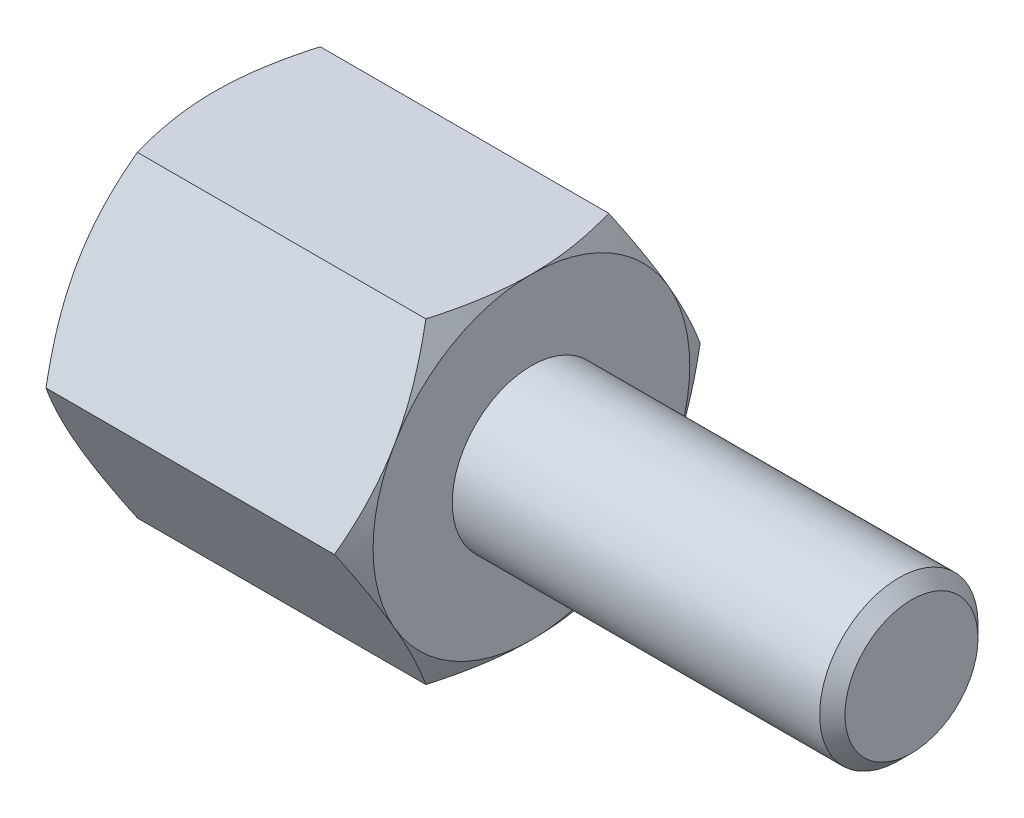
from build123d import *

# Parameters (mm, degrees)
EXTRUDE2_DEPTH = 2.5
SKETCH3_R      = 1.05
EXTRUDE3_DEPTH = 2.5
SKETCH5_R      = 1.25
EXTRUDE4_DEPTH = 6
CHAMFER1_SIZE  = 0.2


with BuildPart() as part:
    # Sketch1 → Extrude2 (new, symmetric)
    with BuildSketch(Plane(origin=(0, 0, 0), x_dir=(0, 0, -1), z_dir=(1, 0, 0))):
        Polygon((1.443375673, 2.5), (-1.443375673, 2.5), (-2.886751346, 0), (-1.443375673, -2.5), (1.443375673, -2.5), (2.886751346, 0), align=None)
    extrude(amount=EXTRUDE2_DEPTH, both=True)

    # Sketch2 → Cut-Revolve1 (revolve, cut)
    with BuildSketch(Plane.XY):
        with BuildLine():
            Line((-2.5, 2.5), (-1, 5.098076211))
            ThreePointArc((-1, 5.098076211), (-1.48810136, 6.276457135), (-2.5, 5.5))
            Line((-2.5, 5.5), (-2.5, 2.5))
        make_face()
    cut_revolve1 = revolve(axis=Axis((0, 0, 0), (1, 0, 0)), mode=Mode.SUBTRACT)

    # Mirror1: Cut-Revolve1 across plane
    add(cut_revolve1.mirror(Plane(origin=(0, 0, 0), x_dir=(0, 0, 1), z_dir=(1, 0, 0))), mode=Mode.SUBTRACT)

    # Sketch3 → Extrude3 (cut)
    with BuildSketch(Plane.ZY.offset(2.5)):
        Circle(SKETCH3_R)
    extrude(amount=-EXTRUDE3_DEPTH, mode=Mode.SUBTRACT)

    # Sketch4 → Cut-Revolve2 (revolve, cut)
    with BuildSketch(Plane.XY, mode=Mode.PRIVATE) as cut_revolve2_sk:
        Polygon((0, 0), (0, 1.05), (0.606217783, 0), align=None)
    revolve(cut_revolve2_sk.sketch.rotate(Axis((0.606217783, 0, 0), (-1, 0, 0)), 180), axis=Axis((0.606217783, 0, 0), (-1, 0, 0)), mode=Mode.SUBTRACT)

    # Sketch5 → Extrude4 (add)
    with BuildSketch(Plane(origin=(2.5, 0, 0), x_dir=(0, 0, -1), z_dir=(1, 0, 0))):
        Circle(SKETCH5_R)
    extrude(amount=EXTRUDE4_DEPTH)

    # Chamfer1
    chamfer1_edges = [part.edges().sort_by_distance(p)[0] for p in [
        (8.5, 0, 1.25),
    ]]
    chamfer(chamfer1_edges, length=CHAMFER1_SIZE)


solid = part.part
